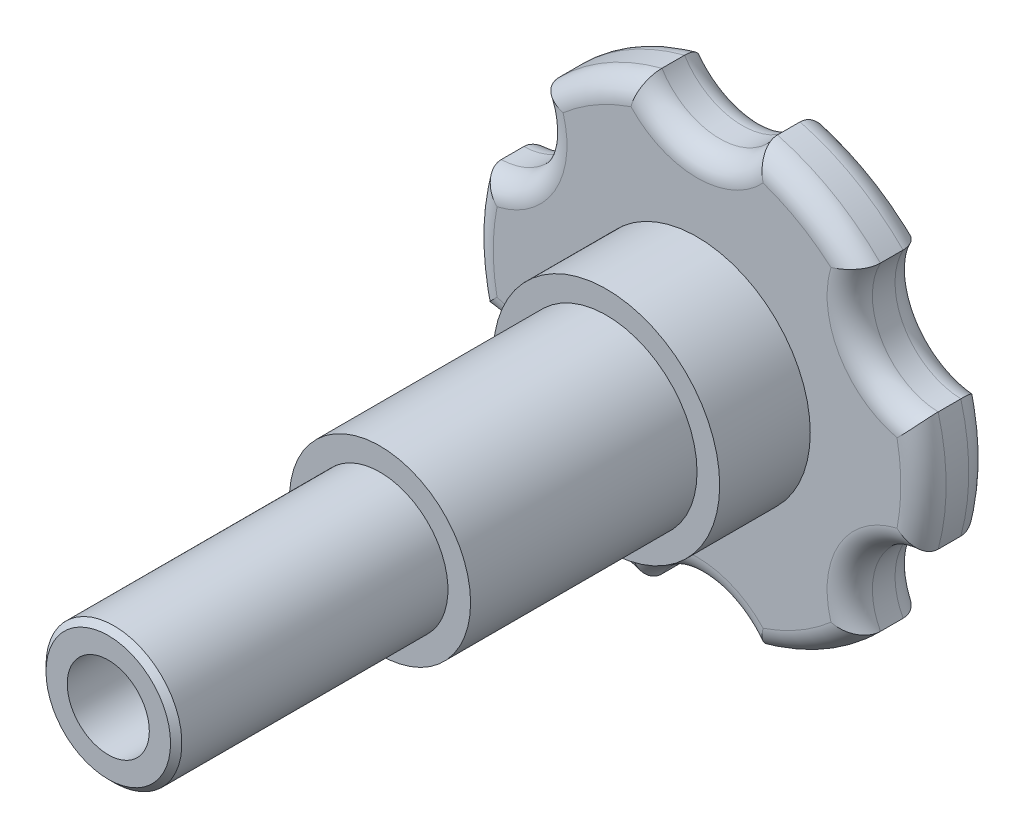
from build123d import *

# Parameters (mm, degrees)
SKETCH1_R           = 31.75
BASE_EXTRUDE_DEPTH  = 9.525
SKETCH2_R           = 9.525
CUT_EXTRUDE2_DEPTH  = 46.900442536
CIRPATTERN1_COUNT   = 6
FILLET1_R           = 3.175
FILLET2_R           = 3.175
SKETCH4_R           = 15.875
BOSS_EXTRUDE1_DEPTH = 12.7
SKETCH5_R           = 12.7
BOSS_EXTRUDE2_DEPTH = 31.75
SKETCH6_R           = 9.525
BOSS_EXTRUDE3_DEPTH = 38.1
CHAMFER1_SIZE       = 0.79375
SKETCH7_R           = 5.75437
CUT_EXTRUDE5_DEPTH  = 103.119479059


with BuildPart() as part:
    # Sketch1 → Base-Extrude (new body)
    with BuildSketch(Plane.XY):
        with Locations(Location((0, 0, 0), (0, 0, 180))):
            Circle(SKETCH1_R)
    extrude(amount=BASE_EXTRUDE_DEPTH)

    # Sketch2 → Cut-Extrude2 (cut, through all)
    with BuildSketch(Plane.XY):
        with Locations((0, 35.71875)):
            Circle(SKETCH2_R)
    cut_extrude2 = extrude(amount=CUT_EXTRUDE2_DEPTH, mode=Mode.SUBTRACT)

    # CirPattern1: Cut-Extrude2 ×6 about axis
    cirpattern1_axis = Axis((0, 0, 0), (0, 0, 1))
    for i in range(1, CIRPATTERN1_COUNT):
        add(cut_extrude2.rotate(cirpattern1_axis, i * 360 / CIRPATTERN1_COUNT), mode=Mode.SUBTRACT)

    # Fillet1
    fillet1_edges = [part.edges().sort_by_distance(p)[0] for p in [
        (15.875, 27.49630657, 9.525),
        (22.68445292, 13.096875, 9.525),
        (31.75, 0, 9.525),
        (22.68445292, -13.096875, 9.525),
        (15.875, -27.49630657, 9.525),
        (0, -26.19375, 9.525),
        (-15.875, -27.49630657, 9.525),
        (-22.68445292, -13.096875, 9.525),
        (-31.75, 0, 9.525),
        (-22.68445292, 13.096875, 9.525),
        (-15.875, 27.49630657, 9.525),
        (0, 26.19375, 9.525),
    ]]
    fillet(fillet1_edges, radius=FILLET1_R)

    # Fillet2
    fillet2_edges = [part.edges().sort_by_distance(p)[0] for p in [
        (15.875, 27.49630657, 0),
        (22.68445292, 13.096875, 0),
        (31.75, 0, 0),
        (22.68445292, -13.096875, 0),
        (15.875, -27.49630657, 0),
        (0, -26.19375, 0),
        (-15.875, -27.49630657, 0),
        (-22.68445292, -13.096875, 0),
        (-31.75, 0, 0),
        (-15.875, 27.49630657, 0),
        (-22.68445292, 13.096875, 0),
        (0, 26.19375, 0),
    ]]
    fillet(fillet2_edges, radius=FILLET2_R)

    # Sketch4 → Boss-Extrude1 (add)
    with BuildSketch(Plane.XY.offset(9.525)):
        Circle(SKETCH4_R)
    extrude(amount=BOSS_EXTRUDE1_DEPTH)

    # Sketch5 → Boss-Extrude2 (add)
    with BuildSketch(Plane.XY.offset(22.225)):
        Circle(SKETCH5_R)
    extrude(amount=BOSS_EXTRUDE2_DEPTH)

    # Sketch6 → Boss-Extrude3 (add)
    with BuildSketch(Plane.XY.offset(53.975)):
        with Locations(Location((0, 0, 0), (0, 0, 180))):
            Circle(SKETCH6_R)
    extrude(amount=BOSS_EXTRUDE3_DEPTH)

    # Chamfer1
    chamfer1_edges = [part.edges().sort_by_distance(p)[0] for p in [
        (9.525, 0, 92.075),
    ]]
    chamfer(chamfer1_edges, length=CHAMFER1_SIZE)

    # Sketch7 → Cut-Extrude5 (cut, through all)
    with BuildSketch(Plane.XY.offset(92.075)):
        Circle(SKETCH7_R)
    extrude(amount=-CUT_EXTRUDE5_DEPTH, mode=Mode.SUBTRACT)


solid = part.part
